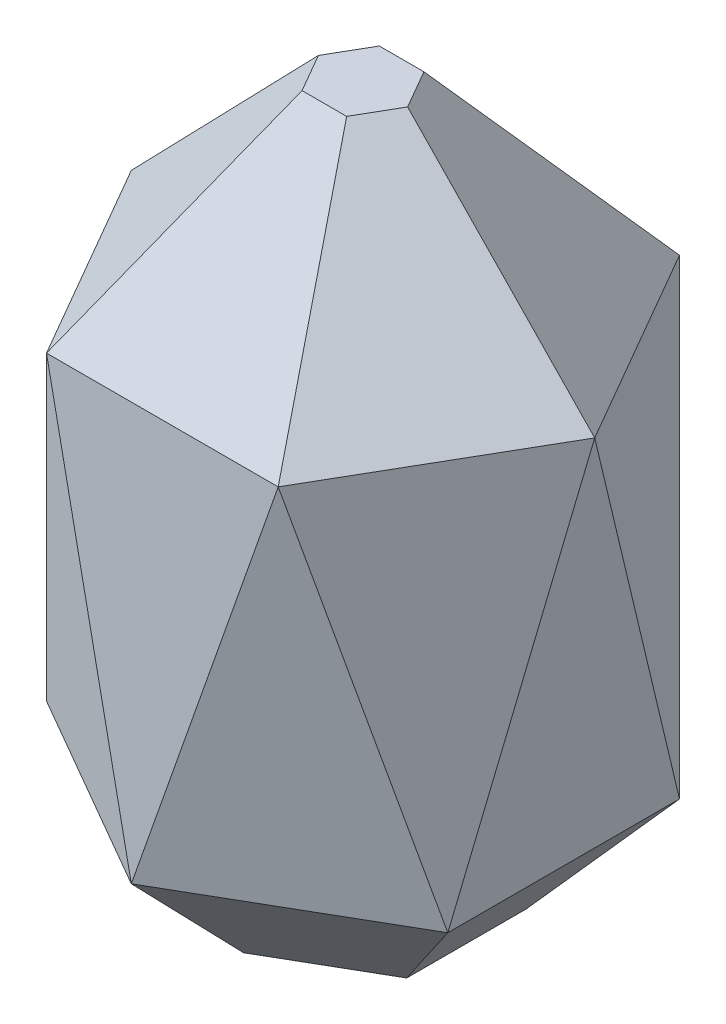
ISO-10303-21;
HEADER;
FILE_DESCRIPTION(('STEP AP214'),'2;1');
FILE_NAME('part.step','',(''),(''),'','','');
FILE_SCHEMA(('AUTOMOTIVE_DESIGN { 1 0 10303 214 1 1 1 1 }'));
ENDSEC;
DATA;
#1=APPLICATION_CONTEXT('core data for automotive mechanical design processes');
#2=APPLICATION_PROTOCOL_DEFINITION('international standard','automotive_design',2000,#1);
#3=PRODUCT_CONTEXT('',#1,'mechanical');
#4=PRODUCT('Part','Part','',(#3));
#5=PRODUCT_RELATED_PRODUCT_CATEGORY('part','',(#4));
#6=PRODUCT_DEFINITION_FORMATION('','',#4);
#7=PRODUCT_DEFINITION_CONTEXT('part definition',#1,'design');
#8=PRODUCT_DEFINITION('design','',#6,#7);
#9=PRODUCT_DEFINITION_SHAPE('','',#8);
#10=(LENGTH_UNIT() NAMED_UNIT(*) SI_UNIT(.MILLI.,.METRE.));
#11=(NAMED_UNIT(*) PLANE_ANGLE_UNIT() SI_UNIT($,.RADIAN.));
#12=(NAMED_UNIT(*) SI_UNIT($,.STERADIAN.) SOLID_ANGLE_UNIT());
#13=UNCERTAINTY_MEASURE_WITH_UNIT(LENGTH_MEASURE(1.E-05),#10,'distance_accuracy_value','');
#14=(GEOMETRIC_REPRESENTATION_CONTEXT(3) GLOBAL_UNCERTAINTY_ASSIGNED_CONTEXT((#13)) GLOBAL_UNIT_ASSIGNED_CONTEXT((#10,
#11,#12)) REPRESENTATION_CONTEXT('',''));
#15=CARTESIAN_POINT('',(0.,0.,0.));
#16=DIRECTION('',(0.,0.,1.));
#17=DIRECTION('',(1.,0.,0.));
#18=AXIS2_PLACEMENT_3D('',#15,#16,#17);
#19=CARTESIAN_POINT('',(60.,100.,0.));
#20=DIRECTION('',(0.663413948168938,0.64278760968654,-0.383022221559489));
#21=DIRECTION('',(-0.695854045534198,0.718183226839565,0.));
#22=AXIS2_PLACEMENT_3D('',#19,#20,#21);
#23=PLANE('',#22);
#24=CARTESIAN_POINT('',(60.,100.,0.));
#25=DIRECTION('',(-0.5,0.,-0.866025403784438));
#26=VECTOR('',#25,1.);
#27=LINE('',#24,#26);
#28=CARTESIAN_POINT('',(60.,100.,5.51642065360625E-13));
#29=VERTEX_POINT('',#28);
#30=CARTESIAN_POINT('',(45.,100.,-25.9807621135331));
#31=VERTEX_POINT('',#30);
#32=EDGE_CURVE('E603',#29,#31,#27,.T.);
#33=ORIENTED_EDGE('',*,*,#32,.T.);
#34=DIRECTION('',(0.5,0.,0.866025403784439));
#35=VECTOR('',#34,1.);
#36=CARTESIAN_POINT('',(30.,100.,-51.9615242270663));
#37=LINE('',#36,#35);
#38=CARTESIAN_POINT('',(30.0000000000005,100.,-51.961524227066));
#39=VERTEX_POINT('',#38);
#40=EDGE_CURVE('E495',#39,#31,#37,.T.);
#41=ORIENTED_EDGE('',*,*,#40,.F.);
#42=DIRECTION('',(0.347927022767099,-0.718183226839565,-0.602627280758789));
#43=VECTOR('',#42,1.);
#44=CARTESIAN_POINT('',(30.,100.,-51.9615242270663));
#45=LINE('',#44,#43);
#46=CARTESIAN_POINT('',(5.77728010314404,150.,-10.0065426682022));
#47=VERTEX_POINT('',#46);
#48=EDGE_CURVE('E372',#47,#39,#45,.T.);
#49=ORIENTED_EDGE('',*,*,#48,.F.);
#50=DIRECTION('',(0.5,0.,0.866025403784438));
#51=VECTOR('',#50,1.);
#52=CARTESIAN_POINT('',(23.6659201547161,150.,20.977490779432));
#53=LINE('',#52,#51);
#54=CARTESIAN_POINT('',(11.5545602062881,150.,0.));
#55=VERTEX_POINT('',#54);
#56=EDGE_CURVE('E465',#55,#47,#53,.F.);
#57=ORIENTED_EDGE('',*,*,#56,.F.);
#58=DIRECTION('',(0.695854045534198,-0.718183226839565,0.));
#59=VECTOR('',#58,1.);
#60=CARTESIAN_POINT('',(60.,100.,0.));
#61=LINE('',#60,#59);
#62=EDGE_CURVE('E456',#55,#29,#61,.T.);
#63=ORIENTED_EDGE('',*,*,#62,.T.);
#64=EDGE_LOOP('',(#33,#41,#49,#57,#63));
#65=FACE_BOUND('',#64,.T.);
#66=ADVANCED_FACE('F46',(#65),#23,.T.);
#67=CARTESIAN_POINT('',(30.,100.,-51.9615242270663));
#68=DIRECTION('',(0.,0.64278760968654,-0.766044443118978));
#69=DIRECTION('',(0.,0.766044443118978,0.64278760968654));
#70=AXIS2_PLACEMENT_3D('',#67,#68,#69);
#71=PLANE('',#70);
#72=CARTESIAN_POINT('',(30.,100.,-51.9615242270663));
#73=DIRECTION('',(-1.,0.,0.));
#74=VECTOR('',#73,1.);
#75=LINE('',#72,#74);
#76=CARTESIAN_POINT('',(0.,100.,-51.9615242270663));
#77=VERTEX_POINT('',#76);
#78=EDGE_CURVE('E642',#39,#77,#75,.T.);
#79=ORIENTED_EDGE('',*,*,#78,.T.);
#80=DIRECTION('',(1.,0.,0.));
#81=VECTOR('',#80,1.);
#82=CARTESIAN_POINT('',(-30.,100.,-51.9615242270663));
#83=LINE('',#82,#81);
#84=CARTESIAN_POINT('',(-30.,100.,-51.9615242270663));
#85=VERTEX_POINT('',#84);
#86=EDGE_CURVE('E383',#85,#77,#83,.T.);
#87=ORIENTED_EDGE('',*,*,#86,.F.);
#88=DIRECTION('',(-0.347927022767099,-0.718183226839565,-0.602627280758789));
#89=VECTOR('',#88,1.);
#90=CARTESIAN_POINT('',(-30.,100.,-51.9615242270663));
#91=LINE('',#90,#89);
#92=CARTESIAN_POINT('',(-5.77728010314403,150.,-10.0065426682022));
#93=VERTEX_POINT('',#92);
#94=EDGE_CURVE('E444',#93,#85,#91,.T.);
#95=ORIENTED_EDGE('',*,*,#94,.F.);
#96=DIRECTION('',(1.,0.,0.));
#97=VECTOR('',#96,1.);
#98=CARTESIAN_POINT('',(30.,150.,-10.0065426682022));
#99=LINE('',#98,#97);
#100=EDGE_CURVE('E463',#47,#93,#99,.F.);
#101=ORIENTED_EDGE('',*,*,#100,.F.);
#102=ORIENTED_EDGE('',*,*,#48,.T.);
#103=EDGE_LOOP('',(#79,#87,#95,#101,#102));
#104=FACE_BOUND('',#103,.T.);
#105=ADVANCED_FACE('F359',(#104),#71,.T.);
#106=CARTESIAN_POINT('',(-30.,100.,-51.9615242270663));
#107=DIRECTION('',(-0.663413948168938,0.64278760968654,-0.383022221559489));
#108=DIRECTION('',(-0.695854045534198,-0.718183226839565,0.));
#109=AXIS2_PLACEMENT_3D('',#106,#107,#108);
#110=PLANE('',#109);
#111=CARTESIAN_POINT('',(-30.,100.,-51.9615242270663));
#112=DIRECTION('',(-0.5,0.,0.866025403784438));
#113=VECTOR('',#112,1.);
#114=LINE('',#111,#113);
#115=CARTESIAN_POINT('',(-45.0000000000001,100.,-25.980762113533));
#116=VERTEX_POINT('',#115);
#117=EDGE_CURVE('E800',#85,#116,#114,.T.);
#118=ORIENTED_EDGE('',*,*,#117,.T.);
#119=DIRECTION('',(0.5,0.,-0.866025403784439));
#120=VECTOR('',#119,1.);
#121=CARTESIAN_POINT('',(-60.,100.,0.));
#122=LINE('',#121,#120);
#123=CARTESIAN_POINT('',(-60.,100.,-2.74086309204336E-13));
#124=VERTEX_POINT('',#123);
#125=EDGE_CURVE('E337',#124,#116,#122,.T.);
#126=ORIENTED_EDGE('',*,*,#125,.F.);
#127=DIRECTION('',(-0.695854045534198,-0.718183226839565,0.));
#128=VECTOR('',#127,1.);
#129=CARTESIAN_POINT('',(-60.,100.,0.));
#130=LINE('',#129,#128);
#131=CARTESIAN_POINT('',(-11.5545602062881,150.,0.));
#132=VERTEX_POINT('',#131);
#133=EDGE_CURVE('E428',#132,#124,#130,.T.);
#134=ORIENTED_EDGE('',*,*,#133,.F.);
#135=DIRECTION('',(0.5,0.,-0.866025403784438));
#136=VECTOR('',#135,1.);
#137=CARTESIAN_POINT('',(6.33407984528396,150.,-30.9840334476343));
#138=LINE('',#137,#136);
#139=EDGE_CURVE('E461',#93,#132,#138,.F.);
#140=ORIENTED_EDGE('',*,*,#139,.F.);
#141=ORIENTED_EDGE('',*,*,#94,.T.);
#142=EDGE_LOOP('',(#118,#126,#134,#140,#141));
#143=FACE_BOUND('',#142,.T.);
#144=ADVANCED_FACE('F349',(#143),#110,.T.);
#145=CARTESIAN_POINT('',(-60.,100.,0.));
#146=DIRECTION('',(-0.663413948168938,0.64278760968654,0.383022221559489));
#147=DIRECTION('',(-0.695854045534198,-0.718183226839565,0.));
#148=AXIS2_PLACEMENT_3D('',#145,#146,#147);
#149=PLANE('',#148);
#150=CARTESIAN_POINT('',(-60.,100.,0.));
#151=DIRECTION('',(0.5,0.,0.866025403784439));
#152=VECTOR('',#151,1.);
#153=LINE('',#150,#152);
#154=CARTESIAN_POINT('',(-45.,100.,25.9807621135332));
#155=VERTEX_POINT('',#154);
#156=EDGE_CURVE('E434',#124,#155,#153,.T.);
#157=ORIENTED_EDGE('',*,*,#156,.T.);
#158=DIRECTION('',(-0.5,0.,-0.866025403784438));
#159=VECTOR('',#158,1.);
#160=CARTESIAN_POINT('',(-30.,100.,51.9615242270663));
#161=LINE('',#160,#159);
#162=CARTESIAN_POINT('',(-30.0000000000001,100.,51.9615242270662));
#163=VERTEX_POINT('',#162);
#164=EDGE_CURVE('E679',#163,#155,#161,.T.);
#165=ORIENTED_EDGE('',*,*,#164,.F.);
#166=DIRECTION('',(-0.347927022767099,-0.718183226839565,0.602627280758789));
#167=VECTOR('',#166,1.);
#168=CARTESIAN_POINT('',(-30.,100.,51.9615242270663));
#169=LINE('',#168,#167);
#170=CARTESIAN_POINT('',(-5.77728010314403,150.,10.0065426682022));
#171=VERTEX_POINT('',#170);
#172=EDGE_CURVE('E420',#171,#163,#169,.T.);
#173=ORIENTED_EDGE('',*,*,#172,.F.);
#174=DIRECTION('',(-0.5,0.,-0.866025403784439));
#175=VECTOR('',#174,1.);
#176=CARTESIAN_POINT('',(-23.6659201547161,150.,-20.977490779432));
#177=LINE('',#176,#175);
#178=EDGE_CURVE('E459',#132,#171,#177,.F.);
#179=ORIENTED_EDGE('',*,*,#178,.F.);
#180=ORIENTED_EDGE('',*,*,#133,.T.);
#181=EDGE_LOOP('',(#157,#165,#173,#179,#180));
#182=FACE_BOUND('',#181,.T.);
#183=ADVANCED_FACE('F358',(#182),#149,.T.);
#184=CARTESIAN_POINT('',(-30.,100.,51.9615242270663));
#185=DIRECTION('',(0.,0.64278760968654,0.766044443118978));
#186=DIRECTION('',(0.,-0.766044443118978,0.64278760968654));
#187=AXIS2_PLACEMENT_3D('',#184,#185,#186);
#188=PLANE('',#187);
#189=CARTESIAN_POINT('',(-30.,100.,51.9615242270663));
#190=DIRECTION('',(1.,0.,0.));
#191=VECTOR('',#190,1.);
#192=LINE('',#189,#191);
#193=CARTESIAN_POINT('',(30.,100.,51.9615242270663));
#194=VERTEX_POINT('',#193);
#195=EDGE_CURVE('E734',#163,#194,#192,.T.);
#196=ORIENTED_EDGE('',*,*,#195,.T.);
#197=DIRECTION('',(0.347927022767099,-0.718183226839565,0.602627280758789));
#198=VECTOR('',#197,1.);
#199=CARTESIAN_POINT('',(30.,100.,51.9615242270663));
#200=LINE('',#199,#198);
#201=CARTESIAN_POINT('',(5.77728010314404,150.,10.0065426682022));
#202=VERTEX_POINT('',#201);
#203=EDGE_CURVE('E398',#202,#194,#200,.T.);
#204=ORIENTED_EDGE('',*,*,#203,.F.);
#205=DIRECTION('',(-1.,0.,0.));
#206=VECTOR('',#205,1.);
#207=CARTESIAN_POINT('',(-30.,150.,10.0065426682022));
#208=LINE('',#207,#206);
#209=EDGE_CURVE('E457',#171,#202,#208,.F.);
#210=ORIENTED_EDGE('',*,*,#209,.F.);
#211=ORIENTED_EDGE('',*,*,#172,.T.);
#212=EDGE_LOOP('',(#196,#204,#210,#211));
#213=FACE_BOUND('',#212,.T.);
#214=ADVANCED_FACE('F409',(#213),#188,.T.);
#215=CARTESIAN_POINT('',(30.,100.,51.9615242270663));
#216=DIRECTION('',(0.663413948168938,0.64278760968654,0.383022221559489));
#217=DIRECTION('',(-0.695854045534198,0.718183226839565,0.));
#218=AXIS2_PLACEMENT_3D('',#215,#216,#217);
#219=PLANE('',#218);
#220=CARTESIAN_POINT('',(30.,100.,51.9615242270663));
#221=DIRECTION('',(0.5,0.,-0.866025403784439));
#222=VECTOR('',#221,1.);
#223=LINE('',#220,#222);
#224=CARTESIAN_POINT('',(45.,100.,25.9807621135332));
#225=VERTEX_POINT('',#224);
#226=EDGE_CURVE('E69',#194,#225,#223,.T.);
#227=ORIENTED_EDGE('',*,*,#226,.T.);
#228=DIRECTION('',(-0.5,0.,0.866025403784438));
#229=VECTOR('',#228,1.);
#230=CARTESIAN_POINT('',(60.,100.,0.));
#231=LINE('',#230,#229);
#232=EDGE_CURVE('E388',#29,#225,#231,.T.);
#233=ORIENTED_EDGE('',*,*,#232,.F.);
#234=ORIENTED_EDGE('',*,*,#62,.F.);
#235=DIRECTION('',(-0.5,0.,0.866025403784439));
#236=VECTOR('',#235,1.);
#237=CARTESIAN_POINT('',(-6.33407984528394,150.,30.9840334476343));
#238=LINE('',#237,#236);
#239=EDGE_CURVE('E453',#202,#55,#238,.F.);
#240=ORIENTED_EDGE('',*,*,#239,.F.);
#241=ORIENTED_EDGE('',*,*,#203,.T.);
#242=EDGE_LOOP('',(#227,#233,#234,#240,#241));
#243=FACE_BOUND('',#242,.T.);
#244=ADVANCED_FACE('F401',(#243),#219,.T.);
#245=CARTESIAN_POINT('',(0.,150.,0.));
#246=DIRECTION('',(0.,1.,0.));
#247=DIRECTION('',(0.,0.,1.));
#248=AXIS2_PLACEMENT_3D('',#245,#246,#247);
#249=PLANE('',#248);
#250=ORIENTED_EDGE('',*,*,#56,.T.);
#251=ORIENTED_EDGE('',*,*,#100,.T.);
#252=ORIENTED_EDGE('',*,*,#139,.T.);
#253=ORIENTED_EDGE('',*,*,#178,.T.);
#254=ORIENTED_EDGE('',*,*,#209,.T.);
#255=ORIENTED_EDGE('',*,*,#239,.T.);
#256=EDGE_LOOP('',(#250,#251,#252,#253,#254,#255));
#257=FACE_BOUND('',#256,.T.);
#258=ADVANCED_FACE('F233',(#257),#249,.T.);
#259=CARTESIAN_POINT('',(-51.9615242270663,0.,-30.));
#260=DIRECTION('',(-0.766044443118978,-0.64278760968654,0.));
#261=DIRECTION('',(0.64278760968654,-0.766044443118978,0.));
#262=AXIS2_PLACEMENT_3D('',#259,#260,#261);
#263=PLANE('',#262);
#264=DIRECTION('',(0.,0.,-1.));
#265=VECTOR('',#264,1.);
#266=CARTESIAN_POINT('',(-26.7885352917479,-30.,-30.));
#267=LINE('',#266,#265);
#268=CARTESIAN_POINT('',(-26.7885352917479,-30.,15.4663680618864));
#269=VERTEX_POINT('',#268);
#270=CARTESIAN_POINT('',(-26.7885352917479,-30.,-15.4663680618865));
#271=VERTEX_POINT('',#270);
#272=EDGE_CURVE('E171',#269,#271,#267,.T.);
#273=ORIENTED_EDGE('',*,*,#272,.F.);
#274=DIRECTION('',(-0.602627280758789,0.718183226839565,0.347927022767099));
#275=VECTOR('',#274,1.);
#276=CARTESIAN_POINT('',(-39.381305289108,-14.9925211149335,22.7368072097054));
#277=LINE('',#276,#275);
#278=CARTESIAN_POINT('',(-51.9615242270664,0.,29.9999999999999));
#279=VERTEX_POINT('',#278);
#280=EDGE_CURVE('E180',#269,#279,#277,.T.);
#281=ORIENTED_EDGE('',*,*,#280,.T.);
#282=DIRECTION('',(0.,0.,1.));
#283=VECTOR('',#282,1.);
#284=CARTESIAN_POINT('',(-51.9615242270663,0.,-30.));
#285=LINE('',#284,#283);
#286=CARTESIAN_POINT('',(-51.9615242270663,0.,0.));
#287=VERTEX_POINT('',#286);
#288=EDGE_CURVE('E330',#287,#279,#285,.T.);
#289=ORIENTED_EDGE('',*,*,#288,.F.);
#290=CARTESIAN_POINT('',(-51.9615242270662,0.,-30.0000000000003));
#291=VERTEX_POINT('',#290);
#292=EDGE_CURVE('E215',#291,#287,#285,.T.);
#293=ORIENTED_EDGE('',*,*,#292,.F.);
#294=DIRECTION('',(-0.602627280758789,0.718183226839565,-0.347927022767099));
#295=VECTOR('',#294,1.);
#296=CARTESIAN_POINT('',(-39.381305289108,-14.9925211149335,-22.7368072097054));
#297=LINE('',#296,#295);
#298=EDGE_CURVE('E183',#271,#291,#297,.T.);
#299=ORIENTED_EDGE('',*,*,#298,.F.);
#300=EDGE_LOOP('',(#273,#281,#289,#293,#299));
#301=FACE_BOUND('',#300,.T.);
#302=ADVANCED_FACE('F179',(#301),#263,.T.);
#303=CARTESIAN_POINT('',(0.,0.,-60.));
#304=DIRECTION('',(-0.383022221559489,-0.64278760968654,-0.663413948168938));
#305=DIRECTION('',(0.,0.718183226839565,-0.695854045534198));
#306=AXIS2_PLACEMENT_3D('',#303,#304,#305);
#307=PLANE('',#306);
#308=DIRECTION('',(0.866025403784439,0.,-0.5));
#309=VECTOR('',#308,1.);
#310=CARTESIAN_POINT('',(12.5864944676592,-30.,-38.1995520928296));
#311=LINE('',#310,#309);
#312=CARTESIAN_POINT('',(0.,-30.,-30.9327361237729));
#313=VERTEX_POINT('',#312);
#314=EDGE_CURVE('E185',#271,#313,#311,.T.);
#315=ORIENTED_EDGE('',*,*,#314,.F.);
#316=ORIENTED_EDGE('',*,*,#298,.T.);
#317=DIRECTION('',(-0.866025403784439,0.,0.5));
#318=VECTOR('',#317,1.);
#319=CARTESIAN_POINT('',(0.,0.,-60.));
#320=LINE('',#319,#318);
#321=CARTESIAN_POINT('',(-25.9807621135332,0.,-45.));
#322=VERTEX_POINT('',#321);
#323=EDGE_CURVE('E326',#322,#291,#320,.T.);
#324=ORIENTED_EDGE('',*,*,#323,.F.);
#325=CARTESIAN_POINT('',(0.,0.,-60.));
#326=VERTEX_POINT('',#325);
#327=EDGE_CURVE('E493',#326,#322,#320,.T.);
#328=ORIENTED_EDGE('',*,*,#327,.F.);
#329=DIRECTION('',(0.,0.718183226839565,-0.695854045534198));
#330=VECTOR('',#329,1.);
#331=CARTESIAN_POINT('',(0.,-14.9925211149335,-45.4736144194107));
#332=LINE('',#331,#330);
#333=EDGE_CURVE('E289',#313,#326,#332,.T.);
#334=ORIENTED_EDGE('',*,*,#333,.F.);
#335=EDGE_LOOP('',(#315,#316,#324,#328,#334));
#336=FACE_BOUND('',#335,.T.);
#337=ADVANCED_FACE('F232',(#336),#307,.T.);
#338=CARTESIAN_POINT('',(51.9615242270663,0.,-30.));
#339=DIRECTION('',(0.383022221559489,-0.64278760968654,-0.663413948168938));
#340=DIRECTION('',(0.,0.718183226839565,-0.695854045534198));
#341=AXIS2_PLACEMENT_3D('',#338,#339,#340);
#342=PLANE('',#341);
#343=DIRECTION('',(0.866025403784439,0.,0.5));
#344=VECTOR('',#343,1.);
#345=CARTESIAN_POINT('',(39.3750297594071,-30.,-8.19955209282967));
#346=LINE('',#345,#344);
#347=CARTESIAN_POINT('',(26.7885352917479,-30.,-15.4663680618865));
#348=VERTEX_POINT('',#347);
#349=EDGE_CURVE('E867',#313,#348,#346,.T.);
#350=ORIENTED_EDGE('',*,*,#349,.F.);
#351=ORIENTED_EDGE('',*,*,#333,.T.);
#352=DIRECTION('',(-0.866025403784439,0.,-0.5));
#353=VECTOR('',#352,1.);
#354=CARTESIAN_POINT('',(51.9615242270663,0.,-30.));
#355=LINE('',#354,#353);
#356=CARTESIAN_POINT('',(25.9807621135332,0.,-45.));
#357=VERTEX_POINT('',#356);
#358=EDGE_CURVE('E767',#357,#326,#355,.T.);
#359=ORIENTED_EDGE('',*,*,#358,.F.);
#360=CARTESIAN_POINT('',(51.9615242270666,0.,-29.9999999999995));
#361=VERTEX_POINT('',#360);
#362=EDGE_CURVE('E494',#361,#357,#355,.T.);
#363=ORIENTED_EDGE('',*,*,#362,.F.);
#364=DIRECTION('',(0.602627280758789,0.718183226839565,-0.347927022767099));
#365=VECTOR('',#364,1.);
#366=CARTESIAN_POINT('',(39.381305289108,-14.9925211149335,-22.7368072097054));
#367=LINE('',#366,#365);
#368=EDGE_CURVE('E287',#348,#361,#367,.T.);
#369=ORIENTED_EDGE('',*,*,#368,.F.);
#370=EDGE_LOOP('',(#350,#351,#359,#363,#369));
#371=FACE_BOUND('',#370,.T.);
#372=ADVANCED_FACE('F298',(#371),#342,.T.);
#373=CARTESIAN_POINT('',(51.9615242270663,0.,30.));
#374=DIRECTION('',(0.766044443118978,-0.64278760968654,0.));
#375=DIRECTION('',(0.64278760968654,0.766044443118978,0.));
#376=AXIS2_PLACEMENT_3D('',#373,#374,#375);
#377=PLANE('',#376);
#378=DIRECTION('',(0.,0.,1.));
#379=VECTOR('',#378,1.);
#380=CARTESIAN_POINT('',(26.7885352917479,-30.,30.));
#381=LINE('',#380,#379);
#382=CARTESIAN_POINT('',(26.7885352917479,-30.,15.4663680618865));
#383=VERTEX_POINT('',#382);
#384=EDGE_CURVE('E869',#348,#383,#381,.T.);
#385=ORIENTED_EDGE('',*,*,#384,.F.);
#386=ORIENTED_EDGE('',*,*,#368,.T.);
#387=DIRECTION('',(0.,0.,-1.));
#388=VECTOR('',#387,1.);
#389=CARTESIAN_POINT('',(51.9615242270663,0.,30.));
#390=LINE('',#389,#388);
#391=CARTESIAN_POINT('',(51.9615242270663,0.,0.));
#392=VERTEX_POINT('',#391);
#393=EDGE_CURVE('E271',#392,#361,#390,.T.);
#394=ORIENTED_EDGE('',*,*,#393,.F.);
#395=CARTESIAN_POINT('',(51.961524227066,0.,30.0000000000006));
#396=VERTEX_POINT('',#395);
#397=EDGE_CURVE('E202',#396,#392,#390,.T.);
#398=ORIENTED_EDGE('',*,*,#397,.F.);
#399=DIRECTION('',(0.602627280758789,0.718183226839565,0.347927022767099));
#400=VECTOR('',#399,1.);
#401=CARTESIAN_POINT('',(39.381305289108,-14.9925211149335,22.7368072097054));
#402=LINE('',#401,#400);
#403=EDGE_CURVE('E195',#383,#396,#402,.T.);
#404=ORIENTED_EDGE('',*,*,#403,.F.);
#405=EDGE_LOOP('',(#385,#386,#394,#398,#404));
#406=FACE_BOUND('',#405,.T.);
#407=ADVANCED_FACE('F244',(#406),#377,.T.);
#408=CARTESIAN_POINT('',(0.,0.,60.));
#409=DIRECTION('',(0.383022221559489,-0.64278760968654,0.663413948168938));
#410=DIRECTION('',(0.,-0.718183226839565,-0.695854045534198));
#411=AXIS2_PLACEMENT_3D('',#408,#409,#410);
#412=PLANE('',#411);
#413=DIRECTION('',(-0.866025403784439,0.,0.5));
#414=VECTOR('',#413,1.);
#415=CARTESIAN_POINT('',(-12.5864944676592,-30.,38.1995520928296));
#416=LINE('',#415,#414);
#417=CARTESIAN_POINT('',(0.,-30.,30.9327361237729));
#418=VERTEX_POINT('',#417);
#419=EDGE_CURVE('E61',#383,#418,#416,.T.);
#420=ORIENTED_EDGE('',*,*,#419,.F.);
#421=ORIENTED_EDGE('',*,*,#403,.T.);
#422=DIRECTION('',(0.866025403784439,0.,-0.5));
#423=VECTOR('',#422,1.);
#424=CARTESIAN_POINT('',(0.,0.,60.));
#425=LINE('',#424,#423);
#426=CARTESIAN_POINT('',(25.9807621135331,0.,45.0000000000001));
#427=VERTEX_POINT('',#426);
#428=EDGE_CURVE('E265',#427,#396,#425,.T.);
#429=ORIENTED_EDGE('',*,*,#428,.F.);
#430=CARTESIAN_POINT('',(0.,0.,60.));
#431=VERTEX_POINT('',#430);
#432=EDGE_CURVE('E768',#431,#427,#425,.T.);
#433=ORIENTED_EDGE('',*,*,#432,.F.);
#434=DIRECTION('',(0.,0.718183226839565,0.695854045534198));
#435=VECTOR('',#434,1.);
#436=CARTESIAN_POINT('',(0.,-14.9925211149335,45.4736144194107));
#437=LINE('',#436,#435);
#438=EDGE_CURVE('E192',#418,#431,#437,.T.);
#439=ORIENTED_EDGE('',*,*,#438,.F.);
#440=EDGE_LOOP('',(#420,#421,#429,#433,#439));
#441=FACE_BOUND('',#440,.T.);
#442=ADVANCED_FACE('F240',(#441),#412,.T.);
#443=CARTESIAN_POINT('',(-51.9615242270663,0.,30.));
#444=DIRECTION('',(-0.383022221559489,-0.64278760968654,0.663413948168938));
#445=DIRECTION('',(0.,-0.718183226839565,-0.695854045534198));
#446=AXIS2_PLACEMENT_3D('',#443,#444,#445);
#447=PLANE('',#446);
#448=DIRECTION('',(-0.866025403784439,0.,-0.5));
#449=VECTOR('',#448,1.);
#450=CARTESIAN_POINT('',(-39.3750297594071,-30.,8.19955209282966));
#451=LINE('',#450,#449);
#452=EDGE_CURVE('E168',#418,#269,#451,.T.);
#453=ORIENTED_EDGE('',*,*,#452,.F.);
#454=ORIENTED_EDGE('',*,*,#438,.T.);
#455=DIRECTION('',(0.866025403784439,0.,0.5));
#456=VECTOR('',#455,1.);
#457=CARTESIAN_POINT('',(-51.9615242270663,0.,30.));
#458=LINE('',#457,#456);
#459=CARTESIAN_POINT('',(-25.9807621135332,0.,45.));
#460=VERTEX_POINT('',#459);
#461=EDGE_CURVE('E473',#460,#431,#458,.T.);
#462=ORIENTED_EDGE('',*,*,#461,.F.);
#463=EDGE_CURVE('E189',#279,#460,#458,.T.);
#464=ORIENTED_EDGE('',*,*,#463,.F.);
#465=ORIENTED_EDGE('',*,*,#280,.F.);
#466=EDGE_LOOP('',(#453,#454,#462,#464,#465));
#467=FACE_BOUND('',#466,.T.);
#468=ADVANCED_FACE('F187',(#467),#447,.T.);
#469=CARTESIAN_POINT('',(0.,4.79212017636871,59.6147865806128));
#470=DIRECTION('',(0.,0.0801262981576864,0.996784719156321));
#471=DIRECTION('',(0.,-0.996784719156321,0.0801262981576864));
#472=AXIS2_PLACEMENT_3D('',#469,#470,#471);
#473=PLANE('',#472);
#474=DIRECTION('',(0.28649992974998,-0.954999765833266,0.0767674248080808));
#475=VECTOR('',#474,1.);
#476=CARTESIAN_POINT('',(-15.,50.,55.9807621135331));
#477=LINE('',#476,#475);
#478=EDGE_CURVE('E519',#163,#431,#477,.T.);
#479=ORIENTED_EDGE('',*,*,#478,.T.);
#480=DIRECTION('',(0.28649992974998,0.954999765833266,-0.0767674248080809));
#481=VECTOR('',#480,1.);
#482=CARTESIAN_POINT('',(15.,50.,55.9807621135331));
#483=LINE('',#482,#481);
#484=EDGE_CURVE('E738',#431,#194,#483,.T.);
#485=ORIENTED_EDGE('',*,*,#484,.T.);
#486=ORIENTED_EDGE('',*,*,#195,.F.);
#487=EDGE_LOOP('',(#479,#485,#486));
#488=FACE_BOUND('',#487,.T.);
#489=ADVANCED_FACE('F234',(#488),#473,.T.);
#490=CARTESIAN_POINT('',(25.8139598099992,-4.15009781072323,44.7110899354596));
#491=DIRECTION('',(-0.498392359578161,0.0801262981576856,-0.863240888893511));
#492=DIRECTION('',(-0.866025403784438,0.,0.5));
#493=AXIS2_PLACEMENT_3D('',#490,#491,#492);
#494=PLANE('',#493);
#495=ORIENTED_EDGE('',*,*,#484,.F.);
#496=ORIENTED_EDGE('',*,*,#432,.T.);
#497=ORIENTED_EDGE('',*,*,#428,.T.);
#498=DIRECTION('',(0.209732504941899,-0.954999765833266,-0.209732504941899));
#499=VECTOR('',#498,1.);
#500=CARTESIAN_POINT('',(40.9807621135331,50.,40.9807621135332));
#501=LINE('',#500,#499);
#502=EDGE_CURVE('E514',#194,#396,#501,.T.);
#503=ORIENTED_EDGE('',*,*,#502,.F.);
#504=EDGE_LOOP('',(#495,#496,#497,#503));
#505=FACE_BOUND('',#504,.T.);
#506=ADVANCED_FACE('F704',(#505),#494,.F.);
#507=CARTESIAN_POINT('',(-51.6279196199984,4.79212017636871,29.8073932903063));
#508=DIRECTION('',(-0.863240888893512,0.0801262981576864,0.498392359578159));
#509=DIRECTION('',(-0.0693914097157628,-0.996784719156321,0.040063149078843));
#510=AXIS2_PLACEMENT_3D('',#507,#508,#509);
#511=PLANE('',#510);
#512=DIRECTION('',(0.0767674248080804,-0.954999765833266,0.28649992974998));
#513=VECTOR('',#512,1.);
#514=CARTESIAN_POINT('',(-55.9807621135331,50.,15.));
#515=LINE('',#514,#513);
#516=EDGE_CURVE('E503',#124,#279,#515,.T.);
#517=ORIENTED_EDGE('',*,*,#516,.T.);
#518=DIRECTION('',(-0.209732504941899,-0.954999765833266,-0.209732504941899));
#519=VECTOR('',#518,1.);
#520=CARTESIAN_POINT('',(-40.9807621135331,50.,40.9807621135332));
#521=LINE('',#520,#519);
#522=EDGE_CURVE('E193',#163,#279,#521,.T.);
#523=ORIENTED_EDGE('',*,*,#522,.F.);
#524=ORIENTED_EDGE('',*,*,#164,.T.);
#525=ORIENTED_EDGE('',*,*,#156,.F.);
#526=EDGE_LOOP('',(#517,#523,#524,#525));
#527=FACE_BOUND('',#526,.T.);
#528=ADVANCED_FACE('F528',(#527),#511,.T.);
#529=CARTESIAN_POINT('',(-51.6279196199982,4.79212017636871,-29.8073932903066));
#530=DIRECTION('',(-0.863240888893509,0.0801262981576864,-0.498392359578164));
#531=DIRECTION('',(-0.0693914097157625,-0.996784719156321,-0.0400631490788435));
#532=AXIS2_PLACEMENT_3D('',#529,#530,#531);
#533=PLANE('',#532);
#534=DIRECTION('',(-0.209732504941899,-0.954999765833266,0.209732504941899));
#535=VECTOR('',#534,1.);
#536=CARTESIAN_POINT('',(-40.9807621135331,50.,-40.9807621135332));
#537=LINE('',#536,#535);
#538=EDGE_CURVE('E481',#85,#291,#537,.T.);
#539=ORIENTED_EDGE('',*,*,#538,.T.);
#540=DIRECTION('',(0.0767674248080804,-0.954999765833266,-0.28649992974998));
#541=VECTOR('',#540,1.);
#542=CARTESIAN_POINT('',(-55.9807621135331,50.,-15.));
#543=LINE('',#542,#541);
#544=EDGE_CURVE('E198',#124,#291,#543,.T.);
#545=ORIENTED_EDGE('',*,*,#544,.F.);
#546=ORIENTED_EDGE('',*,*,#125,.T.);
#547=ORIENTED_EDGE('',*,*,#117,.F.);
#548=EDGE_LOOP('',(#539,#545,#546,#547));
#549=FACE_BOUND('',#548,.T.);
#550=ADVANCED_FACE('F658',(#549),#533,.T.);
#551=CARTESIAN_POINT('',(0.,4.79212017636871,-59.6147865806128));
#552=DIRECTION('',(0.,0.0801262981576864,-0.996784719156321));
#553=DIRECTION('',(0.,-0.996784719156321,-0.0801262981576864));
#554=AXIS2_PLACEMENT_3D('',#551,#552,#553);
#555=PLANE('',#554);
#556=DIRECTION('',(0.28649992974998,0.954999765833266,0.0767674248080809));
#557=VECTOR('',#556,1.);
#558=CARTESIAN_POINT('',(15.,50.,-55.9807621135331));
#559=LINE('',#558,#557);
#560=EDGE_CURVE('E506',#326,#39,#559,.T.);
#561=ORIENTED_EDGE('',*,*,#560,.F.);
#562=DIRECTION('',(0.28649992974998,-0.954999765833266,-0.0767674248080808));
#563=VECTOR('',#562,1.);
#564=CARTESIAN_POINT('',(-15.,50.,-55.9807621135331));
#565=LINE('',#564,#563);
#566=EDGE_CURVE('E750',#85,#326,#565,.T.);
#567=ORIENTED_EDGE('',*,*,#566,.F.);
#568=ORIENTED_EDGE('',*,*,#86,.T.);
#569=ORIENTED_EDGE('',*,*,#78,.F.);
#570=EDGE_LOOP('',(#561,#567,#568,#569));
#571=FACE_BOUND('',#570,.T.);
#572=ADVANCED_FACE('F617',(#571),#555,.T.);
#573=CARTESIAN_POINT('',(51.6279196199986,4.79212017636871,-29.8073932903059));
#574=DIRECTION('',(0.863240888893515,0.0801262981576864,-0.498392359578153));
#575=DIRECTION('',(0.0693914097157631,-0.996784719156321,-0.0400631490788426));
#576=AXIS2_PLACEMENT_3D('',#573,#574,#575);
#577=PLANE('',#576);
#578=DIRECTION('',(-0.0767674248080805,-0.954999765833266,-0.28649992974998));
#579=VECTOR('',#578,1.);
#580=CARTESIAN_POINT('',(55.9807621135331,50.,-15.));
#581=LINE('',#580,#579);
#582=EDGE_CURVE('E509',#29,#361,#581,.T.);
#583=ORIENTED_EDGE('',*,*,#582,.T.);
#584=DIRECTION('',(0.209732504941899,-0.954999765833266,0.209732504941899));
#585=VECTOR('',#584,1.);
#586=CARTESIAN_POINT('',(40.9807621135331,50.,-40.9807621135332));
#587=LINE('',#586,#585);
#588=EDGE_CURVE('E745',#39,#361,#587,.T.);
#589=ORIENTED_EDGE('',*,*,#588,.F.);
#590=ORIENTED_EDGE('',*,*,#40,.T.);
#591=ORIENTED_EDGE('',*,*,#32,.F.);
#592=EDGE_LOOP('',(#583,#589,#590,#591));
#593=FACE_BOUND('',#592,.T.);
#594=ADVANCED_FACE('F608',(#593),#577,.T.);
#595=CARTESIAN_POINT('',(51.6279196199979,4.79212017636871,29.807393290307));
#596=DIRECTION('',(0.863240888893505,0.0801262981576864,0.49839235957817));
#597=DIRECTION('',(0.0693914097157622,-0.996784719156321,0.040063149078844));
#598=AXIS2_PLACEMENT_3D('',#595,#596,#597);
#599=PLANE('',#598);
#600=ORIENTED_EDGE('',*,*,#502,.T.);
#601=DIRECTION('',(-0.0767674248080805,-0.954999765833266,0.28649992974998));
#602=VECTOR('',#601,1.);
#603=CARTESIAN_POINT('',(55.9807621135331,50.,15.));
#604=LINE('',#603,#602);
#605=EDGE_CURVE('E740',#29,#396,#604,.T.);
#606=ORIENTED_EDGE('',*,*,#605,.F.);
#607=ORIENTED_EDGE('',*,*,#232,.T.);
#608=ORIENTED_EDGE('',*,*,#226,.F.);
#609=EDGE_LOOP('',(#600,#606,#607,#608));
#610=FACE_BOUND('',#609,.T.);
#611=ADVANCED_FACE('F565',(#610),#599,.T.);
#612=CARTESIAN_POINT('',(-25.8139598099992,-4.15009781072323,44.7110899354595));
#613=DIRECTION('',(0.498392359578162,0.0801262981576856,-0.86324088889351));
#614=DIRECTION('',(-0.866025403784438,0.,-0.500000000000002));
#615=AXIS2_PLACEMENT_3D('',#612,#613,#614);
#616=PLANE('',#615);
#617=ORIENTED_EDGE('',*,*,#522,.T.);
#618=ORIENTED_EDGE('',*,*,#463,.T.);
#619=ORIENTED_EDGE('',*,*,#461,.T.);
#620=ORIENTED_EDGE('',*,*,#478,.F.);
#621=EDGE_LOOP('',(#617,#618,#619,#620));
#622=FACE_BOUND('',#621,.T.);
#623=ADVANCED_FACE('F534',(#622),#616,.F.);
#624=CARTESIAN_POINT('',(-51.6279196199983,-4.15009781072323,-2.25514051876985E-13));
#625=DIRECTION('',(0.996784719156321,0.0801262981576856,0.));
#626=DIRECTION('',(0.,0.,-1.));
#627=AXIS2_PLACEMENT_3D('',#624,#625,#626);
#628=PLANE('',#627);
#629=ORIENTED_EDGE('',*,*,#544,.T.);
#630=ORIENTED_EDGE('',*,*,#292,.T.);
#631=ORIENTED_EDGE('',*,*,#288,.T.);
#632=ORIENTED_EDGE('',*,*,#516,.F.);
#633=EDGE_LOOP('',(#629,#630,#631,#632));
#634=FACE_BOUND('',#633,.T.);
#635=ADVANCED_FACE('F538',(#634),#628,.F.);
#636=CARTESIAN_POINT('',(-25.8139598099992,-4.15009781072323,-44.7110899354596));
#637=DIRECTION('',(0.498392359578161,0.0801262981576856,0.863240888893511));
#638=DIRECTION('',(0.866025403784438,0.,-0.5));
#639=AXIS2_PLACEMENT_3D('',#636,#637,#638);
#640=PLANE('',#639);
#641=ORIENTED_EDGE('',*,*,#566,.T.);
#642=ORIENTED_EDGE('',*,*,#327,.T.);
#643=ORIENTED_EDGE('',*,*,#323,.T.);
#644=ORIENTED_EDGE('',*,*,#538,.F.);
#645=EDGE_LOOP('',(#641,#642,#643,#644));
#646=FACE_BOUND('',#645,.T.);
#647=ADVANCED_FACE('F558',(#646),#640,.F.);
#648=CARTESIAN_POINT('',(25.8139598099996,-4.15009781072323,-44.7110899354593));
#649=DIRECTION('',(-0.498392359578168,0.0801262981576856,0.863240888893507));
#650=DIRECTION('',(0.866025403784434,0.,0.500000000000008));
#651=AXIS2_PLACEMENT_3D('',#648,#649,#650);
#652=PLANE('',#651);
#653=ORIENTED_EDGE('',*,*,#588,.T.);
#654=ORIENTED_EDGE('',*,*,#362,.T.);
#655=ORIENTED_EDGE('',*,*,#358,.T.);
#656=ORIENTED_EDGE('',*,*,#560,.T.);
#657=EDGE_LOOP('',(#653,#654,#655,#656));
#658=FACE_BOUND('',#657,.T.);
#659=ADVANCED_FACE('F803',(#658),#652,.F.);
#660=CARTESIAN_POINT('',(51.6279196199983,-4.15009781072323,5.86336534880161E-13));
#661=DIRECTION('',(-0.996784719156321,0.0801262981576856,0.));
#662=DIRECTION('',(0.,0.,1.));
#663=AXIS2_PLACEMENT_3D('',#660,#661,#662);
#664=PLANE('',#663);
#665=ORIENTED_EDGE('',*,*,#605,.T.);
#666=ORIENTED_EDGE('',*,*,#397,.T.);
#667=ORIENTED_EDGE('',*,*,#393,.T.);
#668=ORIENTED_EDGE('',*,*,#582,.F.);
#669=EDGE_LOOP('',(#665,#666,#667,#668));
#670=FACE_BOUND('',#669,.T.);
#671=ADVANCED_FACE('F836',(#670),#664,.F.);
#672=CARTESIAN_POINT('',(0.,-30.,0.));
#673=DIRECTION('',(0.,1.,0.));
#674=DIRECTION('',(0.,0.,1.));
#675=AXIS2_PLACEMENT_3D('',#672,#673,#674);
#676=PLANE('',#675);
#677=CARTESIAN_POINT('',(0.,-30.,0.));
#678=DIRECTION('',(0.,1.,0.));
#679=DIRECTION('',(0.,0.,1.));
#680=AXIS2_PLACEMENT_3D('',#677,#678,#679);
#681=CIRCLE('',#680,13.0622205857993);
#682=CARTESIAN_POINT('',(0.,-30.,13.0622205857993));
#683=VERTEX_POINT('',#682);
#684=EDGE_CURVE('E54',#683,#683,#681,.T.);
#685=ORIENTED_EDGE('',*,*,#684,.T.);
#686=EDGE_LOOP('',(#685));
#687=FACE_BOUND('',#686,.T.);
#688=ORIENTED_EDGE('',*,*,#272,.T.);
#689=ORIENTED_EDGE('',*,*,#314,.T.);
#690=ORIENTED_EDGE('',*,*,#349,.T.);
#691=ORIENTED_EDGE('',*,*,#384,.T.);
#692=ORIENTED_EDGE('',*,*,#419,.T.);
#693=ORIENTED_EDGE('',*,*,#452,.T.);
#694=EDGE_LOOP('',(#688,#689,#690,#691,#692,#693));
#695=FACE_BOUND('',#694,.T.);
#696=ADVANCED_FACE('F170',(#687,#695),#676,.F.);
#697=CARTESIAN_POINT('',(0.,28.,0.));
#698=DIRECTION('',(0.,-1.,0.));
#699=DIRECTION('',(0.,0.,-1.));
#700=AXIS2_PLACEMENT_3D('',#697,#698,#699);
#701=PLANE('',#700);
#702=CARTESIAN_POINT('',(0.,28.,0.));
#703=DIRECTION('',(0.,-1.,0.));
#704=DIRECTION('',(0.,0.,-1.));
#705=AXIS2_PLACEMENT_3D('',#702,#703,#704);
#706=CIRCLE('',#705,10.);
#707=CARTESIAN_POINT('',(0.,28.,-10.));
#708=VERTEX_POINT('',#707);
#709=EDGE_CURVE('E184',#708,#708,#706,.T.);
#710=ORIENTED_EDGE('',*,*,#709,.T.);
#711=EDGE_LOOP('',(#710));
#712=FACE_BOUND('',#711,.T.);
#713=ADVANCED_FACE('F713',(#712),#701,.T.);
#714=CARTESIAN_POINT('',(0.,28.,0.));
#715=DIRECTION('',(0.,-1.,0.));
#716=DIRECTION('',(0.,0.,-1.));
#717=AXIS2_PLACEMENT_3D('',#714,#715,#716);
#718=CONICAL_SURFACE('',#717,10.,0.0349065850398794);
#719=CARTESIAN_POINT('',(0.,-29.000609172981,0.));
#720=DIRECTION('',(0.,-1.,0.));
#721=DIRECTION('',(0.,0.,-1.));
#722=AXIS2_PLACEMENT_3D('',#719,#720,#721);
#723=CIRCLE('',#722,11.9905051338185);
#724=CARTESIAN_POINT('',(0.,-29.000609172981,-11.9905051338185));
#725=VERTEX_POINT('',#724);
#726=EDGE_CURVE('E12',#725,#725,#723,.T.);
#727=ORIENTED_EDGE('',*,*,#726,.T.);
#728=EDGE_LOOP('',(#727));
#729=FACE_BOUND('',#728,.T.);
#730=ORIENTED_EDGE('',*,*,#709,.F.);
#731=EDGE_LOOP('',(#730));
#732=FACE_BOUND('',#731,.T.);
#733=ADVANCED_FACE('F921',(#729,#732),#718,.F.);
#734=CARTESIAN_POINT('',(0.,-30.,0.));
#735=DIRECTION('',(0.,-1.,0.));
#736=DIRECTION('',(0.,0.,-1.));
#737=AXIS2_PLACEMENT_3D('',#734,#735,#736);
#738=CONICAL_SURFACE('',#737,13.0622205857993,0.820304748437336);
#739=ORIENTED_EDGE('',*,*,#726,.F.);
#740=EDGE_LOOP('',(#739));
#741=FACE_BOUND('',#740,.T.);
#742=ORIENTED_EDGE('',*,*,#684,.F.);
#743=EDGE_LOOP('',(#742));
#744=FACE_BOUND('',#743,.T.);
#745=ADVANCED_FACE('F48',(#741,#744),#738,.F.);
#746=CLOSED_SHELL('',(#66,#105,#144,#183,#214,#244,#258,#302,#337,#372,#407,#442,#468,#489,#506,
#528,#550,#572,#594,#611,#623,#635,#647,#659,#671,#696,#713,#733,#745));
#747=MANIFOLD_SOLID_BREP('B2',#746);
#748=ADVANCED_BREP_SHAPE_REPRESENTATION('',(#18,#747),#14);
#749=SHAPE_DEFINITION_REPRESENTATION(#9,#748);
ENDSEC;
END-ISO-10303-21;
